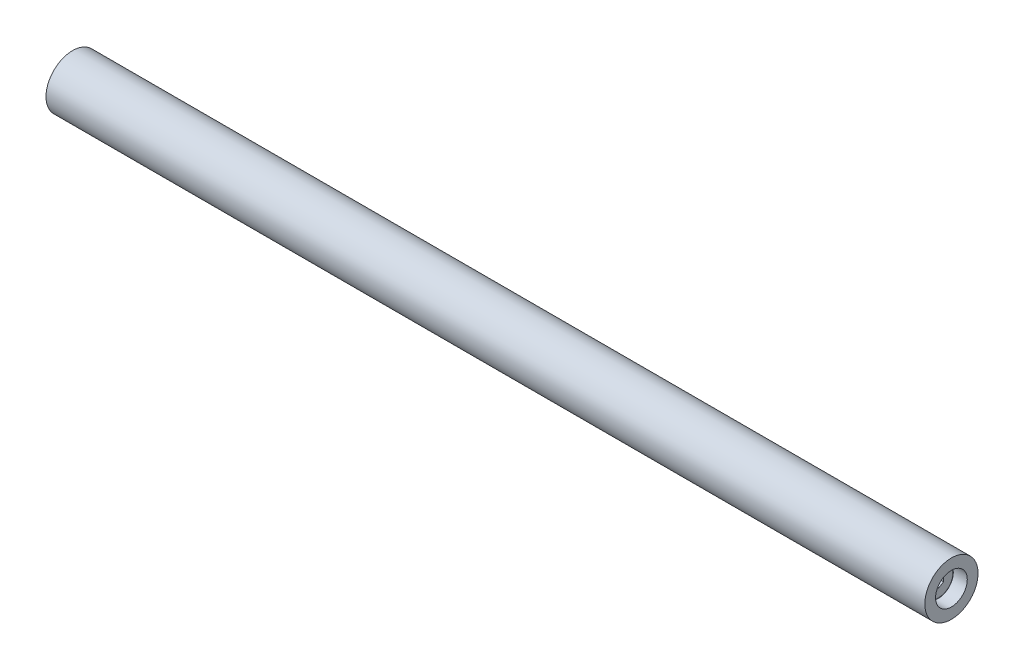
from build123d import *

# Parameters (mm, degrees)
SKETCH1_W          = 330.2
SKETCH1_H          = 10.0076
SKETCH3_R          = 5.9563
CUT_EXTRUDE1_DEPTH = 9.525
CUT_EXTRUDE2_START = 9.525
SKETCH2_R          = 5.9563
CUT_EXTRUDE2_DEPTH = 9.525
CUT_EXTRUDE3_DEPTH = 2.38125
CUT_EXTRUDE4_DEPTH = 2.38125


with BuildPart() as part:
    # Sketch1 → Revolve1 (revolve)
    with BuildSketch(Plane.XY, mode=Mode.PRIVATE) as revolve1_sk:
        with Locations((165.1, 5.0038)):
            Rectangle(SKETCH1_W, SKETCH1_H)
    revolve(revolve1_sk.sketch.rotate(Axis((330.2, 0, 0), (-1, 0, 0)), 270), axis=Axis((330.2, 0, 0), (-1, 0, 0)))

    # Sketch3 → Cut-Extrude1 (cut)
    with BuildSketch(Plane(origin=(330.2, 0, 0), x_dir=(0, 0, -1), z_dir=(1, 0, 0))):
        Circle(SKETCH3_R)
    extrude(amount=-CUT_EXTRUDE1_DEPTH, mode=Mode.SUBTRACT)

    # Sketch2 → Cut-Extrude2 (cut)
    with BuildSketch(Plane(origin=(0, 0, 0), x_dir=(0, 0, -1), z_dir=(1, 0, 0)).offset(CUT_EXTRUDE2_START)):
        Circle(SKETCH2_R)
    extrude(amount=-CUT_EXTRUDE2_DEPTH, mode=Mode.SUBTRACT)

    # Sketch4 → Revolve2 (revolve)
    with BuildSketch(Plane.XY, mode=Mode.PRIVATE) as revolve2_sk:
        with BuildLine():
            Line((4.7625, 0), (4.7625, 5.2578))
            ThreePointArc((4.7625, 5.2578), (4.911289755, 5.617010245), (5.2705, 5.7658))
            Line((5.2705, 5.7658), (9.525, 5.7658))
            Line((9.525, 5.7658), (9.525, 0))
            Line((9.525, 0), (4.7625, 0))
        make_face()
    revolve(revolve2_sk.sketch.rotate(Axis((9.525, 0, 0), (-1, 0, 0)), 270), axis=Axis((9.525, 0, 0), (-1, 0, 0)))

    # Sketch5 → Revolve3 (revolve)
    with BuildSketch(Plane.XY, mode=Mode.PRIVATE) as revolve3_sk:
        with BuildLine():
            Line((320.675, 0), (320.675, 5.7658))
            Line((320.675, 5.7658), (324.9295, 5.7658))
            ThreePointArc((324.9295, 5.7658), (325.288710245, 5.617010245), (325.4375, 5.2578))
            Line((325.4375, 5.2578), (325.4375, 0))
            Line((325.4375, 0), (320.675, 0))
        make_face()
    revolve(revolve3_sk.sketch.rotate(Axis((325.4375, 0, 0), (-1, 0, 0)), 270), axis=Axis((325.4375, 0, 0), (-1, 0, 0)))

    # Sketch7 → Cut-Extrude3 (cut)
    with BuildSketch(Plane(origin=(325.4375, 0, 0), x_dir=(0, 0, -1), z_dir=(1, 0, 0))):
        Polygon((-1.83515, 1.059524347), (-1.83515, -1.059524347), (0, -2.119048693), (1.83515, -1.059524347), (1.83515, 1.059524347), (0, 2.119048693), align=None)
    extrude(amount=-CUT_EXTRUDE3_DEPTH, mode=Mode.SUBTRACT)

    # Sketch6 → Cut-Extrude4 (cut)
    with BuildSketch(Plane(origin=(4.7625, 0, 0), x_dir=(0, 0, -1), z_dir=(1, 0, 0))):
        Polygon((-1.83515, 1.059524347), (-1.83515, -1.059524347), (0, -2.119048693), (1.83515, -1.059524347), (1.83515, 1.059524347), (0, 2.119048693), align=None)
    extrude(amount=CUT_EXTRUDE4_DEPTH, mode=Mode.SUBTRACT)


solid = part.part
